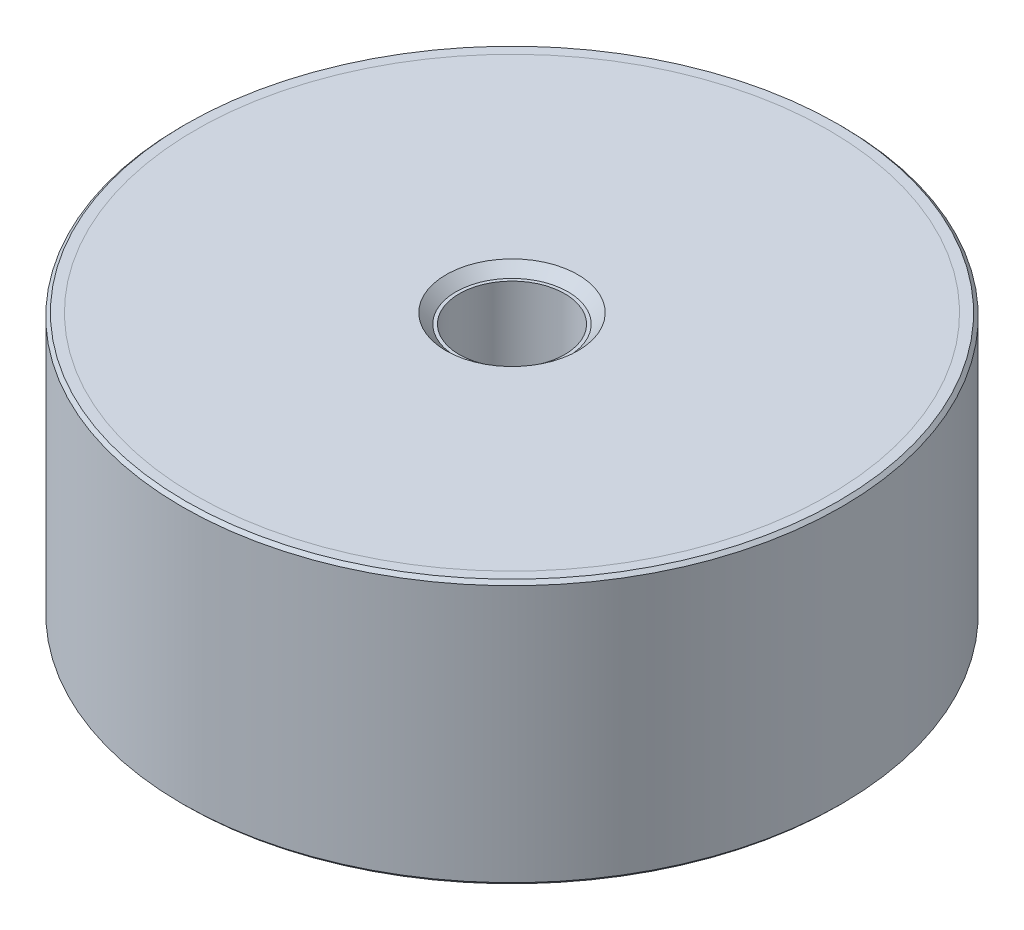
ISO-10303-21;
HEADER;
FILE_DESCRIPTION(('STEP AP214'),'2;1');
FILE_NAME('part.step','',(''),(''),'','','');
FILE_SCHEMA(('AUTOMOTIVE_DESIGN { 1 0 10303 214 1 1 1 1 }'));
ENDSEC;
DATA;
#1=APPLICATION_CONTEXT('core data for automotive mechanical design processes');
#2=APPLICATION_PROTOCOL_DEFINITION('international standard','automotive_design',2000,#1);
#3=PRODUCT_CONTEXT('',#1,'mechanical');
#4=PRODUCT('Part','Part','',(#3));
#5=PRODUCT_RELATED_PRODUCT_CATEGORY('part','',(#4));
#6=PRODUCT_DEFINITION_FORMATION('','',#4);
#7=PRODUCT_DEFINITION_CONTEXT('part definition',#1,'design');
#8=PRODUCT_DEFINITION('design','',#6,#7);
#9=PRODUCT_DEFINITION_SHAPE('','',#8);
#10=(LENGTH_UNIT() NAMED_UNIT(*) SI_UNIT(.MILLI.,.METRE.));
#11=(NAMED_UNIT(*) PLANE_ANGLE_UNIT() SI_UNIT($,.RADIAN.));
#12=(NAMED_UNIT(*) SI_UNIT($,.STERADIAN.) SOLID_ANGLE_UNIT());
#13=UNCERTAINTY_MEASURE_WITH_UNIT(LENGTH_MEASURE(1.E-05),#10,'distance_accuracy_value','');
#14=(GEOMETRIC_REPRESENTATION_CONTEXT(3) GLOBAL_UNCERTAINTY_ASSIGNED_CONTEXT((#13)) GLOBAL_UNIT_ASSIGNED_CONTEXT((#10,
#11,#12)) REPRESENTATION_CONTEXT('',''));
#15=CARTESIAN_POINT('',(0.,0.,0.));
#16=DIRECTION('',(0.,0.,1.));
#17=DIRECTION('',(1.,0.,0.));
#18=AXIS2_PLACEMENT_3D('',#15,#16,#17);
#19=CARTESIAN_POINT('',(0.,-37.,8.));
#20=DIRECTION('',(0.,1.,0.));
#21=DIRECTION('',(0.,0.,1.));
#22=AXIS2_PLACEMENT_3D('',#19,#20,#21);
#23=PLANE('',#22);
#24=CARTESIAN_POINT('',(0.,-37.,0.));
#25=DIRECTION('',(0.,1.,0.));
#26=DIRECTION('',(0.,0.,1.));
#27=AXIS2_PLACEMENT_3D('',#24,#25,#26);
#28=CIRCLE('',#27,8.50000000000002);
#29=CARTESIAN_POINT('',(0.,-37.,8.50000000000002));
#30=VERTEX_POINT('',#29);
#31=EDGE_CURVE('P0_E10',#30,#30,#28,.F.);
#32=ORIENTED_EDGE('',*,*,#31,.T.);
#33=EDGE_LOOP('',(#32));
#34=FACE_BOUND('',#33,.T.);
#35=CARTESIAN_POINT('',(0.,-37.,0.));
#36=DIRECTION('',(0.,1.,0.));
#37=DIRECTION('',(0.,0.,1.));
#38=AXIS2_PLACEMENT_3D('',#35,#36,#37);
#39=CIRCLE('',#38,48.);
#40=CARTESIAN_POINT('',(0.,-37.,48.));
#41=VERTEX_POINT('',#40);
#42=EDGE_CURVE('P0_E25',#41,#41,#39,.T.);
#43=ORIENTED_EDGE('',*,*,#42,.T.);
#44=EDGE_LOOP('',(#43));
#45=FACE_BOUND('',#44,.T.);
#46=ADVANCED_FACE('P0_F14',(#34,#45),#23,.T.);
#47=CARTESIAN_POINT('',(0.,31.0340428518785,0.));
#48=DIRECTION('',(0.,1.,0.));
#49=DIRECTION('',(0.,0.,1.));
#50=AXIS2_PLACEMENT_3D('',#47,#48,#49);
#51=CYLINDRICAL_SURFACE('',#50,48.);
#52=CARTESIAN_POINT('',(0.,-38.5,0.));
#53=DIRECTION('',(0.,1.,0.));
#54=DIRECTION('',(0.,0.,1.));
#55=AXIS2_PLACEMENT_3D('',#52,#53,#54);
#56=CIRCLE('',#55,48.);
#57=CARTESIAN_POINT('',(0.,-38.5,48.));
#58=VERTEX_POINT('',#57);
#59=EDGE_CURVE('P0_E29',#58,#58,#56,.T.);
#60=ORIENTED_EDGE('',*,*,#59,.T.);
#61=EDGE_LOOP('',(#60));
#62=FACE_BOUND('',#61,.T.);
#63=ORIENTED_EDGE('',*,*,#42,.F.);
#64=EDGE_LOOP('',(#63));
#65=FACE_BOUND('',#64,.T.);
#66=ADVANCED_FACE('P0_F35',(#62,#65),#51,.T.);
#67=CARTESIAN_POINT('',(0.,-38.5,48.));
#68=DIRECTION('',(0.,-1.,0.));
#69=DIRECTION('',(0.,0.,-1.));
#70=AXIS2_PLACEMENT_3D('',#67,#68,#69);
#71=PLANE('',#70);
#72=CARTESIAN_POINT('',(0.,-38.5,0.));
#73=DIRECTION('',(0.,-1.,0.));
#74=DIRECTION('',(0.,0.,-1.));
#75=AXIS2_PLACEMENT_3D('',#72,#73,#74);
#76=CIRCLE('',#75,10.);
#77=CARTESIAN_POINT('',(0.,-38.5,-10.));
#78=VERTEX_POINT('',#77);
#79=EDGE_CURVE('P0_E21',#78,#78,#76,.F.);
#80=ORIENTED_EDGE('',*,*,#79,.T.);
#81=EDGE_LOOP('',(#80));
#82=FACE_BOUND('',#81,.T.);
#83=ORIENTED_EDGE('',*,*,#59,.F.);
#84=EDGE_LOOP('',(#83));
#85=FACE_BOUND('',#84,.T.);
#86=ADVANCED_FACE('P0_F38',(#82,#85),#71,.T.);
#87=CARTESIAN_POINT('',(0.,-38.5,0.));
#88=DIRECTION('',(0.,-1.,0.));
#89=DIRECTION('',(0.,0.,-1.));
#90=AXIS2_PLACEMENT_3D('',#87,#88,#89);
#91=CONICAL_SURFACE('',#90,10.,0.785398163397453);
#92=ORIENTED_EDGE('',*,*,#31,.F.);
#93=EDGE_LOOP('',(#92));
#94=FACE_BOUND('',#93,.T.);
#95=ORIENTED_EDGE('',*,*,#79,.F.);
#96=EDGE_LOOP('',(#95));
#97=FACE_BOUND('',#96,.T.);
#98=ADVANCED_FACE('P0_F16',(#94,#97),#91,.F.);
#99=CLOSED_SHELL('',(#46,#66,#86,#98));
#100=MANIFOLD_SOLID_BREP('P0_B1',#99);
#101=CARTESIAN_POINT('',(0.,1.5,8.));
#102=DIRECTION('',(0.,1.,0.));
#103=DIRECTION('',(0.,0.,1.));
#104=AXIS2_PLACEMENT_3D('',#101,#102,#103);
#105=PLANE('',#104);
#106=CARTESIAN_POINT('',(0.,1.5,0.));
#107=DIRECTION('',(0.,1.,0.));
#108=DIRECTION('',(0.,0.,1.));
#109=AXIS2_PLACEMENT_3D('',#106,#107,#108);
#110=CIRCLE('',#109,10.);
#111=CARTESIAN_POINT('',(0.,1.5,10.));
#112=VERTEX_POINT('',#111);
#113=EDGE_CURVE('P1_E10',#112,#112,#110,.F.);
#114=ORIENTED_EDGE('',*,*,#113,.T.);
#115=EDGE_LOOP('',(#114));
#116=FACE_BOUND('',#115,.T.);
#117=CARTESIAN_POINT('',(0.,1.5,0.));
#118=DIRECTION('',(0.,1.,0.));
#119=DIRECTION('',(0.,0.,1.));
#120=AXIS2_PLACEMENT_3D('',#117,#118,#119);
#121=CIRCLE('',#120,48.);
#122=CARTESIAN_POINT('',(0.,1.5,48.));
#123=VERTEX_POINT('',#122);
#124=EDGE_CURVE('P1_E25',#123,#123,#121,.T.);
#125=ORIENTED_EDGE('',*,*,#124,.T.);
#126=EDGE_LOOP('',(#125));
#127=FACE_BOUND('',#126,.T.);
#128=ADVANCED_FACE('P1_F14',(#116,#127),#105,.T.);
#129=CARTESIAN_POINT('',(0.,69.5340428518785,0.));
#130=DIRECTION('',(0.,1.,0.));
#131=DIRECTION('',(0.,0.,1.));
#132=AXIS2_PLACEMENT_3D('',#129,#130,#131);
#133=CYLINDRICAL_SURFACE('',#132,48.);
#134=CARTESIAN_POINT('',(0.,0.,0.));
#135=DIRECTION('',(0.,1.,0.));
#136=DIRECTION('',(0.,0.,1.));
#137=AXIS2_PLACEMENT_3D('',#134,#135,#136);
#138=CIRCLE('',#137,48.);
#139=CARTESIAN_POINT('',(0.,0.,48.));
#140=VERTEX_POINT('',#139);
#141=EDGE_CURVE('P1_E29',#140,#140,#138,.T.);
#142=ORIENTED_EDGE('',*,*,#141,.T.);
#143=EDGE_LOOP('',(#142));
#144=FACE_BOUND('',#143,.T.);
#145=ORIENTED_EDGE('',*,*,#124,.F.);
#146=EDGE_LOOP('',(#145));
#147=FACE_BOUND('',#146,.T.);
#148=ADVANCED_FACE('P1_F35',(#144,#147),#133,.T.);
#149=CARTESIAN_POINT('',(0.,0.,48.));
#150=DIRECTION('',(0.,-1.,0.));
#151=DIRECTION('',(0.,0.,-1.));
#152=AXIS2_PLACEMENT_3D('',#149,#150,#151);
#153=PLANE('',#152);
#154=CARTESIAN_POINT('',(0.,0.,0.));
#155=DIRECTION('',(0.,-1.,0.));
#156=DIRECTION('',(0.,0.,-1.));
#157=AXIS2_PLACEMENT_3D('',#154,#155,#156);
#158=CIRCLE('',#157,8.50000000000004);
#159=CARTESIAN_POINT('',(0.,0.,-8.50000000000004));
#160=VERTEX_POINT('',#159);
#161=EDGE_CURVE('P1_E21',#160,#160,#158,.F.);
#162=ORIENTED_EDGE('',*,*,#161,.T.);
#163=EDGE_LOOP('',(#162));
#164=FACE_BOUND('',#163,.T.);
#165=ORIENTED_EDGE('',*,*,#141,.F.);
#166=EDGE_LOOP('',(#165));
#167=FACE_BOUND('',#166,.T.);
#168=ADVANCED_FACE('P1_F38',(#164,#167),#153,.T.);
#169=CARTESIAN_POINT('',(0.,-0.500000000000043,0.));
#170=DIRECTION('',(0.,1.,0.));
#171=DIRECTION('',(0.,0.,1.));
#172=AXIS2_PLACEMENT_3D('',#169,#170,#171);
#173=CONICAL_SURFACE('',#172,8.,0.785398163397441);
#174=ORIENTED_EDGE('',*,*,#113,.F.);
#175=EDGE_LOOP('',(#174));
#176=FACE_BOUND('',#175,.T.);
#177=ORIENTED_EDGE('',*,*,#161,.F.);
#178=EDGE_LOOP('',(#177));
#179=FACE_BOUND('',#178,.T.);
#180=ADVANCED_FACE('P1_F16',(#176,#179),#173,.F.);
#181=CLOSED_SHELL('',(#128,#148,#168,#180));
#182=MANIFOLD_SOLID_BREP('P1_B1',#181);
#183=CARTESIAN_POINT('',(0.,0.,0.));
#184=DIRECTION('',(0.,1.,0.));
#185=DIRECTION('',(0.,0.,1.));
#186=AXIS2_PLACEMENT_3D('',#183,#184,#185);
#187=PLANE('',#186);
#188=CARTESIAN_POINT('',(0.,0.,0.));
#189=DIRECTION('',(0.,1.,0.));
#190=DIRECTION('',(0.,0.,1.));
#191=AXIS2_PLACEMENT_3D('',#188,#189,#190);
#192=CIRCLE('',#191,8.);
#193=CARTESIAN_POINT('',(0.,0.,8.));
#194=VERTEX_POINT('',#193);
#195=EDGE_CURVE('P2_E46',#194,#194,#192,.T.);
#196=ORIENTED_EDGE('',*,*,#195,.F.);
#197=EDGE_LOOP('',(#196));
#198=FACE_BOUND('',#197,.T.);
#199=CARTESIAN_POINT('',(0.,0.,0.));
#200=DIRECTION('',(0.,1.,0.));
#201=DIRECTION('',(0.,0.,1.));
#202=AXIS2_PLACEMENT_3D('',#199,#200,#201);
#203=CIRCLE('',#202,48.);
#204=CARTESIAN_POINT('',(0.,0.,48.));
#205=VERTEX_POINT('',#204);
#206=EDGE_CURVE('P2_E33',#205,#205,#203,.T.);
#207=ORIENTED_EDGE('',*,*,#206,.T.);
#208=EDGE_LOOP('',(#207));
#209=FACE_BOUND('',#208,.T.);
#210=ADVANCED_FACE('P2_F13',(#198,#209),#187,.T.);
#211=CARTESIAN_POINT('',(0.,65.5134936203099,0.));
#212=DIRECTION('',(0.,1.,0.));
#213=DIRECTION('',(0.,0.,1.));
#214=AXIS2_PLACEMENT_3D('',#211,#212,#213);
#215=CYLINDRICAL_SURFACE('',#214,48.);
#216=CARTESIAN_POINT('',(0.,1.49999999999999,0.));
#217=DIRECTION('',(0.,1.,0.));
#218=DIRECTION('',(0.,0.,1.));
#219=AXIS2_PLACEMENT_3D('',#216,#217,#218);
#220=CIRCLE('',#219,48.);
#221=CARTESIAN_POINT('',(0.,1.49999999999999,48.));
#222=VERTEX_POINT('',#221);
#223=EDGE_CURVE('P2_E36',#222,#222,#220,.T.);
#224=ORIENTED_EDGE('',*,*,#223,.T.);
#225=EDGE_LOOP('',(#224));
#226=FACE_BOUND('',#225,.T.);
#227=ORIENTED_EDGE('',*,*,#206,.F.);
#228=EDGE_LOOP('',(#227));
#229=FACE_BOUND('',#228,.T.);
#230=ADVANCED_FACE('P2_F92',(#226,#229),#215,.F.);
#231=CARTESIAN_POINT('',(0.,1.49999999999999,48.));
#232=DIRECTION('',(0.,1.,0.));
#233=DIRECTION('',(0.,0.,1.));
#234=AXIS2_PLACEMENT_3D('',#231,#232,#233);
#235=PLANE('',#234);
#236=CARTESIAN_POINT('',(0.,1.49999999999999,0.));
#237=DIRECTION('',(0.,1.,0.));
#238=DIRECTION('',(0.,0.,1.));
#239=AXIS2_PLACEMENT_3D('',#236,#237,#238);
#240=CIRCLE('',#239,49.5);
#241=CARTESIAN_POINT('',(0.,1.49999999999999,49.5));
#242=VERTEX_POINT('',#241);
#243=EDGE_CURVE('P2_E9',#242,#242,#240,.T.);
#244=ORIENTED_EDGE('',*,*,#243,.T.);
#245=EDGE_LOOP('',(#244));
#246=FACE_BOUND('',#245,.T.);
#247=ORIENTED_EDGE('',*,*,#223,.F.);
#248=EDGE_LOOP('',(#247));
#249=FACE_BOUND('',#248,.T.);
#250=ADVANCED_FACE('P2_F88',(#246,#249),#235,.T.);
#251=CARTESIAN_POINT('',(0.,65.5134936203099,0.));
#252=DIRECTION('',(0.,1.,0.));
#253=DIRECTION('',(0.,0.,1.));
#254=AXIS2_PLACEMENT_3D('',#251,#252,#253);
#255=CYLINDRICAL_SURFACE('',#254,50.);
#256=CARTESIAN_POINT('',(0.,-38.,0.));
#257=DIRECTION('',(0.,-1.,0.));
#258=DIRECTION('',(0.,0.,-1.));
#259=AXIS2_PLACEMENT_3D('',#256,#257,#258);
#260=CIRCLE('',#259,50.);
#261=CARTESIAN_POINT('',(0.,-38.,-50.));
#262=VERTEX_POINT('',#261);
#263=EDGE_CURVE('P2_E24',#262,#262,#260,.F.);
#264=ORIENTED_EDGE('',*,*,#263,.T.);
#265=EDGE_LOOP('',(#264));
#266=FACE_BOUND('',#265,.T.);
#267=CARTESIAN_POINT('',(0.,1.,0.));
#268=DIRECTION('',(0.,1.,0.));
#269=DIRECTION('',(0.,0.,1.));
#270=AXIS2_PLACEMENT_3D('',#267,#268,#269);
#271=CIRCLE('',#270,50.);
#272=CARTESIAN_POINT('',(0.,1.,50.));
#273=VERTEX_POINT('',#272);
#274=EDGE_CURVE('P2_E28',#273,#273,#271,.F.);
#275=ORIENTED_EDGE('',*,*,#274,.T.);
#276=EDGE_LOOP('',(#275));
#277=FACE_BOUND('',#276,.T.);
#278=ADVANCED_FACE('P2_F82',(#266,#277),#255,.T.);
#279=CARTESIAN_POINT('',(0.,-38.5,50.));
#280=DIRECTION('',(0.,-1.,0.));
#281=DIRECTION('',(0.,0.,-1.));
#282=AXIS2_PLACEMENT_3D('',#279,#280,#281);
#283=PLANE('',#282);
#284=CARTESIAN_POINT('',(0.,-38.5,0.));
#285=DIRECTION('',(0.,-1.,0.));
#286=DIRECTION('',(0.,0.,-1.));
#287=AXIS2_PLACEMENT_3D('',#284,#285,#286);
#288=CIRCLE('',#287,49.5);
#289=CARTESIAN_POINT('',(0.,-38.5,-49.5));
#290=VERTEX_POINT('',#289);
#291=EDGE_CURVE('P2_E20',#290,#290,#288,.T.);
#292=ORIENTED_EDGE('',*,*,#291,.T.);
#293=EDGE_LOOP('',(#292));
#294=FACE_BOUND('',#293,.T.);
#295=CARTESIAN_POINT('',(0.,-38.5,0.));
#296=DIRECTION('',(0.,1.,0.));
#297=DIRECTION('',(0.,0.,1.));
#298=AXIS2_PLACEMENT_3D('',#295,#296,#297);
#299=CIRCLE('',#298,48.);
#300=CARTESIAN_POINT('',(0.,-38.5,48.));
#301=VERTEX_POINT('',#300);
#302=EDGE_CURVE('P2_E39',#301,#301,#299,.T.);
#303=ORIENTED_EDGE('',*,*,#302,.T.);
#304=EDGE_LOOP('',(#303));
#305=FACE_BOUND('',#304,.T.);
#306=ADVANCED_FACE('P2_F77',(#294,#305),#283,.T.);
#307=CARTESIAN_POINT('',(0.,65.5134936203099,0.));
#308=DIRECTION('',(0.,1.,0.));
#309=DIRECTION('',(0.,0.,1.));
#310=AXIS2_PLACEMENT_3D('',#307,#308,#309);
#311=CYLINDRICAL_SURFACE('',#310,48.);
#312=CARTESIAN_POINT('',(0.,-37.,0.));
#313=DIRECTION('',(0.,1.,0.));
#314=DIRECTION('',(0.,0.,1.));
#315=AXIS2_PLACEMENT_3D('',#312,#313,#314);
#316=CIRCLE('',#315,48.);
#317=CARTESIAN_POINT('',(0.,-37.,48.));
#318=VERTEX_POINT('',#317);
#319=EDGE_CURVE('P2_E42',#318,#318,#316,.T.);
#320=ORIENTED_EDGE('',*,*,#319,.T.);
#321=EDGE_LOOP('',(#320));
#322=FACE_BOUND('',#321,.T.);
#323=ORIENTED_EDGE('',*,*,#302,.F.);
#324=EDGE_LOOP('',(#323));
#325=FACE_BOUND('',#324,.T.);
#326=ADVANCED_FACE('P2_F71',(#322,#325),#311,.F.);
#327=CARTESIAN_POINT('',(0.,-37.,48.));
#328=DIRECTION('',(0.,-1.,0.));
#329=DIRECTION('',(0.,0.,-1.));
#330=AXIS2_PLACEMENT_3D('',#327,#328,#329);
#331=PLANE('',#330);
#332=CARTESIAN_POINT('',(0.,-37.,0.));
#333=DIRECTION('',(0.,-1.,0.));
#334=DIRECTION('',(0.,0.,-1.));
#335=AXIS2_PLACEMENT_3D('',#332,#333,#334);
#336=CIRCLE('',#335,8.);
#337=CARTESIAN_POINT('',(0.,-37.,-8.));
#338=VERTEX_POINT('',#337);
#339=EDGE_CURVE('P2_E52',#338,#338,#336,.T.);
#340=ORIENTED_EDGE('',*,*,#339,.F.);
#341=EDGE_LOOP('',(#340));
#342=FACE_BOUND('',#341,.T.);
#343=ORIENTED_EDGE('',*,*,#319,.F.);
#344=EDGE_LOOP('',(#343));
#345=FACE_BOUND('',#344,.T.);
#346=ADVANCED_FACE('P2_F67',(#342,#345),#331,.T.);
#347=CARTESIAN_POINT('',(0.,-38.,0.));
#348=DIRECTION('',(0.,1.,0.));
#349=DIRECTION('',(0.,0.,1.));
#350=AXIS2_PLACEMENT_3D('',#347,#348,#349);
#351=CONICAL_SURFACE('',#350,50.,0.785398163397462);
#352=ORIENTED_EDGE('',*,*,#291,.F.);
#353=EDGE_LOOP('',(#352));
#354=FACE_BOUND('',#353,.T.);
#355=ORIENTED_EDGE('',*,*,#263,.F.);
#356=EDGE_LOOP('',(#355));
#357=FACE_BOUND('',#356,.T.);
#358=ADVANCED_FACE('P2_F70',(#354,#357),#351,.T.);
#359=CARTESIAN_POINT('',(0.,1.49999999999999,0.));
#360=DIRECTION('',(0.,-1.,0.));
#361=DIRECTION('',(0.,0.,-1.));
#362=AXIS2_PLACEMENT_3D('',#359,#360,#361);
#363=CONICAL_SURFACE('',#362,49.5,0.785398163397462);
#364=ORIENTED_EDGE('',*,*,#274,.F.);
#365=EDGE_LOOP('',(#364));
#366=FACE_BOUND('',#365,.T.);
#367=ORIENTED_EDGE('',*,*,#243,.F.);
#368=EDGE_LOOP('',(#367));
#369=FACE_BOUND('',#368,.T.);
#370=ADVANCED_FACE('P2_F15',(#366,#369),#363,.T.);
#371=CARTESIAN_POINT('',(0.,-14.5,0.));
#372=DIRECTION('',(0.,1.,0.));
#373=DIRECTION('',(0.,0.,1.));
#374=AXIS2_PLACEMENT_3D('',#371,#372,#373);
#375=CYLINDRICAL_SURFACE('',#374,8.);
#376=CARTESIAN_POINT('',(0.,-14.5,0.));
#377=DIRECTION('',(0.,1.,0.));
#378=DIRECTION('',(0.,0.,1.));
#379=AXIS2_PLACEMENT_3D('',#376,#377,#378);
#380=CIRCLE('',#379,8.);
#381=CARTESIAN_POINT('',(0.,-14.5,8.));
#382=VERTEX_POINT('',#381);
#383=EDGE_CURVE('P2_E45',#382,#382,#380,.T.);
#384=CARTESIAN_POINT('',(0.,-14.5,8.));
#385=CARTESIAN_POINT('',(0.,-14.3489583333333,8.));
#386=CARTESIAN_POINT('',(0.,-14.1979166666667,8.));
#387=CARTESIAN_POINT('',(0.,-13.8958333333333,8.));
#388=CARTESIAN_POINT('',(0.,-13.7447916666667,8.));
#389=CARTESIAN_POINT('',(0.,-13.4427083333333,8.));
#390=CARTESIAN_POINT('',(0.,-13.2916666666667,8.));
#391=CARTESIAN_POINT('',(0.,-12.9895833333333,8.));
#392=CARTESIAN_POINT('',(0.,-12.8385416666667,8.));
#393=CARTESIAN_POINT('',(0.,-12.5364583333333,8.));
#394=CARTESIAN_POINT('',(0.,-12.3854166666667,8.));
#395=CARTESIAN_POINT('',(0.,-12.0833333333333,8.));
#396=CARTESIAN_POINT('',(0.,-11.9322916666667,8.));
#397=CARTESIAN_POINT('',(0.,-11.6302083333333,8.));
#398=CARTESIAN_POINT('',(0.,-11.4791666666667,8.));
#399=CARTESIAN_POINT('',(0.,-11.1770833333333,8.));
#400=CARTESIAN_POINT('',(0.,-11.0260416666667,8.));
#401=CARTESIAN_POINT('',(0.,-10.7239583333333,8.));
#402=CARTESIAN_POINT('',(0.,-10.5729166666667,8.));
#403=CARTESIAN_POINT('',(0.,-10.2708333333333,8.));
#404=CARTESIAN_POINT('',(0.,-10.1197916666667,8.));
#405=CARTESIAN_POINT('',(0.,-9.81770833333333,8.));
#406=CARTESIAN_POINT('',(0.,-9.66666666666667,8.));
#407=CARTESIAN_POINT('',(0.,-9.36458333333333,8.));
#408=CARTESIAN_POINT('',(0.,-9.21354166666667,8.));
#409=CARTESIAN_POINT('',(0.,-8.91145833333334,8.));
#410=CARTESIAN_POINT('',(0.,-8.76041666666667,8.));
#411=CARTESIAN_POINT('',(0.,-8.45833333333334,8.));
#412=CARTESIAN_POINT('',(0.,-8.30729166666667,8.));
#413=CARTESIAN_POINT('',(0.,-8.00520833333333,8.));
#414=CARTESIAN_POINT('',(0.,-7.85416666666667,8.));
#415=CARTESIAN_POINT('',(0.,-7.55208333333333,8.));
#416=CARTESIAN_POINT('',(0.,-7.40104166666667,8.));
#417=CARTESIAN_POINT('',(0.,-7.09895833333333,8.));
#418=CARTESIAN_POINT('',(0.,-6.94791666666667,8.));
#419=CARTESIAN_POINT('',(0.,-6.64583333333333,8.));
#420=CARTESIAN_POINT('',(0.,-6.49479166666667,8.));
#421=CARTESIAN_POINT('',(0.,-6.19270833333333,8.));
#422=CARTESIAN_POINT('',(0.,-6.04166666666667,8.));
#423=CARTESIAN_POINT('',(0.,-5.73958333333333,8.));
#424=CARTESIAN_POINT('',(0.,-5.58854166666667,8.));
#425=CARTESIAN_POINT('',(0.,-5.28645833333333,8.));
#426=CARTESIAN_POINT('',(0.,-5.13541666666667,8.));
#427=CARTESIAN_POINT('',(0.,-4.83333333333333,8.));
#428=CARTESIAN_POINT('',(0.,-4.68229166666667,8.));
#429=CARTESIAN_POINT('',(0.,-4.38020833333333,8.));
#430=CARTESIAN_POINT('',(0.,-4.22916666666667,8.));
#431=CARTESIAN_POINT('',(0.,-3.92708333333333,8.));
#432=CARTESIAN_POINT('',(0.,-3.77604166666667,8.));
#433=CARTESIAN_POINT('',(0.,-3.47395833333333,8.));
#434=CARTESIAN_POINT('',(0.,-3.32291666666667,8.));
#435=CARTESIAN_POINT('',(0.,-3.02083333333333,8.));
#436=CARTESIAN_POINT('',(0.,-2.86979166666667,8.));
#437=CARTESIAN_POINT('',(0.,-2.56770833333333,8.));
#438=CARTESIAN_POINT('',(0.,-2.41666666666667,8.));
#439=CARTESIAN_POINT('',(0.,-2.11458333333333,8.));
#440=CARTESIAN_POINT('',(0.,-1.96354166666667,8.));
#441=CARTESIAN_POINT('',(0.,-1.66145833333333,8.));
#442=CARTESIAN_POINT('',(0.,-1.51041666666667,8.));
#443=CARTESIAN_POINT('',(0.,-1.20833333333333,8.));
#444=CARTESIAN_POINT('',(0.,-1.05729166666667,8.));
#445=CARTESIAN_POINT('',(0.,-0.755208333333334,8.));
#446=CARTESIAN_POINT('',(0.,-0.604166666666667,8.));
#447=CARTESIAN_POINT('',(0.,-0.302083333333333,8.));
#448=CARTESIAN_POINT('',(0.,-0.151041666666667,8.));
#449=CARTESIAN_POINT('',(0.,0.,8.));
#450=B_SPLINE_CURVE_WITH_KNOTS('',3,(#384,#385,#386,#387,#388,#389,#390,#391,#392,#393,#394,
#395,#396,#397,#398,#399,#400,#401,#402,#403,#404,#405,#406,#407,#408,#409,#410,#411,#412,#413,
#414,#415,#416,#417,#418,#419,#420,#421,#422,#423,#424,#425,#426,#427,#428,#429,#430,#431,#432,
#433,#434,#435,#436,#437,#438,#439,#440,#441,#442,#443,#444,#445,#446,#447,#448,#449),
.UNSPECIFIED.,.F.,.F.,(4,2,2,2,2,2,2,2,2,2,2,2,2,2,2,2,2,2,2,2,2,2,2,2,2,2,2,2,2,2,2,2,4),(0.,
0.453124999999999,0.906249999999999,1.359375,1.8125,2.265625,2.71875,3.171875,3.625,4.078125,
4.53125,4.984375,5.4375,5.890625,6.34375,6.796875,7.25,7.703125,8.15625,8.609375,9.0625,
9.515625,9.96875,10.421875,10.875,11.328125,11.78125,12.234375,12.6875,13.140625,13.59375,
14.046875,14.5),.UNSPECIFIED.);
#451=EDGE_CURVE('P2_BSEAM108',#382,#194,#450,.T.);
#452=ORIENTED_EDGE('',*,*,#383,.F.);
#453=ORIENTED_EDGE('',*,*,#195,.T.);
#454=ORIENTED_EDGE('',*,*,#451,.T.);
#455=ORIENTED_EDGE('',*,*,#451,.F.);
#456=EDGE_LOOP('',(#452,#454,#453,#455));
#457=FACE_BOUND('',#456,.T.);
#458=ADVANCED_FACE('P2_F108',(#457),#375,.F.);
#459=CARTESIAN_POINT('',(0.,-14.5,0.));
#460=DIRECTION('',(0.,1.,0.));
#461=DIRECTION('',(0.,0.,1.));
#462=AXIS2_PLACEMENT_3D('',#459,#460,#461);
#463=PLANE('',#462);
#464=ORIENTED_EDGE('',*,*,#383,.T.);
#465=EDGE_LOOP('',(#464));
#466=FACE_BOUND('',#465,.T.);
#467=ADVANCED_FACE('P2_F63',(#466),#463,.T.);
#468=CARTESIAN_POINT('',(0.,-22.5,0.));
#469=DIRECTION('',(0.,-1.,0.));
#470=DIRECTION('',(0.,0.,-1.));
#471=AXIS2_PLACEMENT_3D('',#468,#469,#470);
#472=CYLINDRICAL_SURFACE('',#471,8.);
#473=CARTESIAN_POINT('',(0.,-22.5,0.));
#474=DIRECTION('',(0.,-1.,0.));
#475=DIRECTION('',(0.,0.,-1.));
#476=AXIS2_PLACEMENT_3D('',#473,#474,#475);
#477=CIRCLE('',#476,8.);
#478=CARTESIAN_POINT('',(0.,-22.5,-8.));
#479=VERTEX_POINT('',#478);
#480=EDGE_CURVE('P2_E49',#479,#479,#477,.T.);
#481=CARTESIAN_POINT('',(0.,-22.5,-8.));
#482=CARTESIAN_POINT('',(0.,-22.6510416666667,-8.));
#483=CARTESIAN_POINT('',(0.,-22.8020833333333,-8.));
#484=CARTESIAN_POINT('',(0.,-23.1041666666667,-8.));
#485=CARTESIAN_POINT('',(0.,-23.2552083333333,-8.));
#486=CARTESIAN_POINT('',(0.,-23.5572916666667,-8.));
#487=CARTESIAN_POINT('',(0.,-23.7083333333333,-8.));
#488=CARTESIAN_POINT('',(0.,-24.0104166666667,-8.));
#489=CARTESIAN_POINT('',(0.,-24.1614583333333,-8.));
#490=CARTESIAN_POINT('',(0.,-24.4635416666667,-8.));
#491=CARTESIAN_POINT('',(0.,-24.6145833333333,-8.));
#492=CARTESIAN_POINT('',(0.,-24.9166666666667,-8.));
#493=CARTESIAN_POINT('',(0.,-25.0677083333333,-8.));
#494=CARTESIAN_POINT('',(0.,-25.3697916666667,-8.));
#495=CARTESIAN_POINT('',(0.,-25.5208333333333,-8.));
#496=CARTESIAN_POINT('',(0.,-25.8229166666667,-8.));
#497=CARTESIAN_POINT('',(0.,-25.9739583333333,-8.));
#498=CARTESIAN_POINT('',(0.,-26.2760416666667,-8.));
#499=CARTESIAN_POINT('',(0.,-26.4270833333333,-8.));
#500=CARTESIAN_POINT('',(0.,-26.7291666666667,-8.));
#501=CARTESIAN_POINT('',(0.,-26.8802083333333,-8.));
#502=CARTESIAN_POINT('',(0.,-27.1822916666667,-8.));
#503=CARTESIAN_POINT('',(0.,-27.3333333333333,-8.));
#504=CARTESIAN_POINT('',(0.,-27.6354166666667,-8.));
#505=CARTESIAN_POINT('',(0.,-27.7864583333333,-8.));
#506=CARTESIAN_POINT('',(0.,-28.0885416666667,-8.));
#507=CARTESIAN_POINT('',(0.,-28.2395833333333,-8.));
#508=CARTESIAN_POINT('',(0.,-28.5416666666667,-8.));
#509=CARTESIAN_POINT('',(0.,-28.6927083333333,-8.));
#510=CARTESIAN_POINT('',(0.,-28.9947916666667,-8.));
#511=CARTESIAN_POINT('',(0.,-29.1458333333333,-8.));
#512=CARTESIAN_POINT('',(0.,-29.4479166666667,-8.));
#513=CARTESIAN_POINT('',(0.,-29.5989583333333,-8.));
#514=CARTESIAN_POINT('',(0.,-29.9010416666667,-8.));
#515=CARTESIAN_POINT('',(0.,-30.0520833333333,-8.));
#516=CARTESIAN_POINT('',(0.,-30.3541666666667,-8.));
#517=CARTESIAN_POINT('',(0.,-30.5052083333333,-8.));
#518=CARTESIAN_POINT('',(0.,-30.8072916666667,-8.));
#519=CARTESIAN_POINT('',(0.,-30.9583333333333,-8.));
#520=CARTESIAN_POINT('',(0.,-31.2604166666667,-8.));
#521=CARTESIAN_POINT('',(0.,-31.4114583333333,-8.));
#522=CARTESIAN_POINT('',(0.,-31.7135416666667,-8.));
#523=CARTESIAN_POINT('',(0.,-31.8645833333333,-8.));
#524=CARTESIAN_POINT('',(0.,-32.1666666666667,-8.));
#525=CARTESIAN_POINT('',(0.,-32.3177083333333,-8.));
#526=CARTESIAN_POINT('',(0.,-32.6197916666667,-8.));
#527=CARTESIAN_POINT('',(0.,-32.7708333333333,-8.));
#528=CARTESIAN_POINT('',(0.,-33.0729166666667,-8.));
#529=CARTESIAN_POINT('',(0.,-33.2239583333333,-8.));
#530=CARTESIAN_POINT('',(0.,-33.5260416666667,-8.));
#531=CARTESIAN_POINT('',(0.,-33.6770833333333,-8.));
#532=CARTESIAN_POINT('',(0.,-33.9791666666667,-8.));
#533=CARTESIAN_POINT('',(0.,-34.1302083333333,-8.));
#534=CARTESIAN_POINT('',(0.,-34.4322916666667,-8.));
#535=CARTESIAN_POINT('',(0.,-34.5833333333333,-8.));
#536=CARTESIAN_POINT('',(0.,-34.8854166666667,-8.));
#537=CARTESIAN_POINT('',(0.,-35.0364583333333,-8.));
#538=CARTESIAN_POINT('',(0.,-35.3385416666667,-8.));
#539=CARTESIAN_POINT('',(0.,-35.4895833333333,-8.));
#540=CARTESIAN_POINT('',(0.,-35.7916666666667,-8.));
#541=CARTESIAN_POINT('',(0.,-35.9427083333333,-8.));
#542=CARTESIAN_POINT('',(0.,-36.2447916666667,-8.));
#543=CARTESIAN_POINT('',(0.,-36.3958333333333,-8.));
#544=CARTESIAN_POINT('',(0.,-36.6979166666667,-8.));
#545=CARTESIAN_POINT('',(0.,-36.8489583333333,-8.));
#546=CARTESIAN_POINT('',(0.,-37.,-8.));
#547=B_SPLINE_CURVE_WITH_KNOTS('',3,(#481,#482,#483,#484,#485,#486,#487,#488,#489,#490,#491,
#492,#493,#494,#495,#496,#497,#498,#499,#500,#501,#502,#503,#504,#505,#506,#507,#508,#509,#510,
#511,#512,#513,#514,#515,#516,#517,#518,#519,#520,#521,#522,#523,#524,#525,#526,#527,#528,#529,
#530,#531,#532,#533,#534,#535,#536,#537,#538,#539,#540,#541,#542,#543,#544,#545,#546),
.UNSPECIFIED.,.F.,.F.,(4,2,2,2,2,2,2,2,2,2,2,2,2,2,2,2,2,2,2,2,2,2,2,2,2,2,2,2,2,2,2,2,4),(0.,
0.453124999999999,0.906249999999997,1.359375,1.8125,2.265625,2.71875,3.171875,3.625,
4.07812499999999,4.53125,4.984375,5.4375,5.890625,6.34375,6.796875,7.25,7.70312499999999,
8.15625,8.60937499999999,9.06249999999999,9.51562499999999,9.96875,10.421875,10.875,11.328125,
11.78125,12.234375,12.6875,13.140625,13.59375,14.046875,14.5),.UNSPECIFIED.);
#548=EDGE_CURVE('P2_BSEAM60',#479,#338,#547,.T.);
#549=ORIENTED_EDGE('',*,*,#480,.F.);
#550=ORIENTED_EDGE('',*,*,#339,.T.);
#551=ORIENTED_EDGE('',*,*,#548,.T.);
#552=ORIENTED_EDGE('',*,*,#548,.F.);
#553=EDGE_LOOP('',(#549,#551,#550,#552));
#554=FACE_BOUND('',#553,.T.);
#555=ADVANCED_FACE('P2_F60',(#554),#472,.F.);
#556=CARTESIAN_POINT('',(0.,-22.5,0.));
#557=DIRECTION('',(0.,-1.,0.));
#558=DIRECTION('',(0.,0.,-1.));
#559=AXIS2_PLACEMENT_3D('',#556,#557,#558);
#560=PLANE('',#559);
#561=ORIENTED_EDGE('',*,*,#480,.T.);
#562=EDGE_LOOP('',(#561));
#563=FACE_BOUND('',#562,.T.);
#564=ADVANCED_FACE('P2_F58',(#563),#560,.T.);
#565=CLOSED_SHELL('',(#210,#230,#250,#278,#306,#326,#346,#358,#370,#458,#467,#555,#564));
#566=MANIFOLD_SOLID_BREP('P2_B1',#565);
#567=ADVANCED_BREP_SHAPE_REPRESENTATION('',(#18,#100,#182,#566),#14);
#568=SHAPE_DEFINITION_REPRESENTATION(#9,#567);
ENDSEC;
END-ISO-10303-21;
